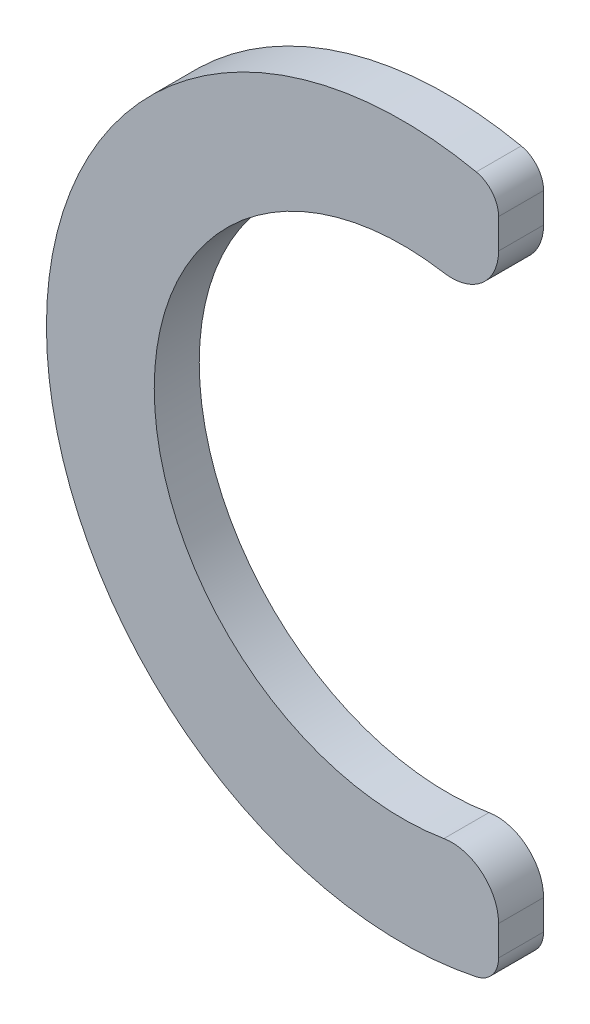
ISO-10303-21;
HEADER;
FILE_DESCRIPTION(('STEP AP214'),'2;1');
FILE_NAME('part.step','',(''),(''),'','','');
FILE_SCHEMA(('AUTOMOTIVE_DESIGN { 1 0 10303 214 1 1 1 1 }'));
ENDSEC;
DATA;
#1=APPLICATION_CONTEXT('core data for automotive mechanical design processes');
#2=APPLICATION_PROTOCOL_DEFINITION('international standard','automotive_design',2000,#1);
#3=PRODUCT_CONTEXT('',#1,'mechanical');
#4=PRODUCT('Part','Part','',(#3));
#5=PRODUCT_RELATED_PRODUCT_CATEGORY('part','',(#4));
#6=PRODUCT_DEFINITION_FORMATION('','',#4);
#7=PRODUCT_DEFINITION_CONTEXT('part definition',#1,'design');
#8=PRODUCT_DEFINITION('design','',#6,#7);
#9=PRODUCT_DEFINITION_SHAPE('','',#8);
#10=(LENGTH_UNIT() NAMED_UNIT(*) SI_UNIT(.MILLI.,.METRE.));
#11=(NAMED_UNIT(*) PLANE_ANGLE_UNIT() SI_UNIT($,.RADIAN.));
#12=(NAMED_UNIT(*) SI_UNIT($,.STERADIAN.) SOLID_ANGLE_UNIT());
#13=UNCERTAINTY_MEASURE_WITH_UNIT(LENGTH_MEASURE(1.E-05),#10,'distance_accuracy_value','');
#14=(GEOMETRIC_REPRESENTATION_CONTEXT(3) GLOBAL_UNCERTAINTY_ASSIGNED_CONTEXT((#13)) GLOBAL_UNIT_ASSIGNED_CONTEXT((#10,
#11,#12)) REPRESENTATION_CONTEXT('',''));
#15=CARTESIAN_POINT('',(0.,0.,0.));
#16=DIRECTION('',(0.,0.,1.));
#17=DIRECTION('',(1.,0.,0.));
#18=AXIS2_PLACEMENT_3D('',#15,#16,#17);
#19=CARTESIAN_POINT('',(1.02320568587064,-3.84665904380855,49.52));
#20=DIRECTION('',(0.,0.,-1.));
#21=DIRECTION('',(-1.,0.,0.));
#22=AXIS2_PLACEMENT_3D('',#19,#20,#21);
#23=PLANE('',#22);
#24=CARTESIAN_POINT('',(0.52320568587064,-3.10624464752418,49.52));
#25=DIRECTION('',(0.,0.,-1.));
#26=DIRECTION('',(0.,1.,0.));
#27=AXIS2_PLACEMENT_3D('',#24,#25,#26);
#28=CIRCLE('',#27,0.5);
#29=CARTESIAN_POINT('',(0.440157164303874,-2.61318994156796,49.52));
#30=VERTEX_POINT('',#29);
#31=CARTESIAN_POINT('',(1.02320568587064,-3.10624464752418,49.52));
#32=VERTEX_POINT('',#31);
#33=EDGE_CURVE('E101',#30,#32,#28,.T.);
#34=ORIENTED_EDGE('',*,*,#33,.T.);
#35=DIRECTION('',(0.,1.,0.));
#36=VECTOR('',#35,1.);
#37=CARTESIAN_POINT('',(1.02320568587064,-3.84665904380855,49.52));
#38=LINE('',#37,#36);
#39=CARTESIAN_POINT('',(1.02320568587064,-3.42446689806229,49.52));
#40=VERTEX_POINT('',#39);
#41=EDGE_CURVE('E100',#32,#40,#38,.F.);
#42=ORIENTED_EDGE('',*,*,#41,.T.);
#43=CARTESIAN_POINT('',(0.72320568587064,-3.42446689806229,49.52));
#44=DIRECTION('',(0.,0.,-1.));
#45=DIRECTION('',(0.,1.,0.));
#46=AXIS2_PLACEMENT_3D('',#43,#44,#45);
#47=CIRCLE('',#46,0.3);
#48=CARTESIAN_POINT('',(0.785194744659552,-3.71799263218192,49.52));
#49=VERTEX_POINT('',#48);
#50=EDGE_CURVE('E20',#40,#49,#47,.T.);
#51=ORIENTED_EDGE('',*,*,#50,.T.);
#52=CARTESIAN_POINT('',(0.,0.,49.52));
#53=DIRECTION('',(0.,0.,-1.));
#54=DIRECTION('',(0.,1.,0.));
#55=AXIS2_PLACEMENT_3D('',#52,#53,#54);
#56=CIRCLE('',#55,3.8);
#57=CARTESIAN_POINT('',(0.785194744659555,3.71799263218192,49.52));
#58=VERTEX_POINT('',#57);
#59=EDGE_CURVE('E83',#58,#49,#56,.F.);
#60=ORIENTED_EDGE('',*,*,#59,.F.);
#61=CARTESIAN_POINT('',(0.72320568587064,3.42446689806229,49.52));
#62=DIRECTION('',(0.,0.,-1.));
#63=DIRECTION('',(0.,1.,0.));
#64=AXIS2_PLACEMENT_3D('',#61,#62,#63);
#65=CIRCLE('',#64,0.3);
#66=CARTESIAN_POINT('',(1.02320568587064,3.42446689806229,49.52));
#67=VERTEX_POINT('',#66);
#68=EDGE_CURVE('E111',#67,#58,#65,.F.);
#69=ORIENTED_EDGE('',*,*,#68,.F.);
#70=DIRECTION('',(0.,1.,0.));
#71=VECTOR('',#70,1.);
#72=CARTESIAN_POINT('',(1.02320568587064,3.10624464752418,49.52));
#73=LINE('',#72,#71);
#74=CARTESIAN_POINT('',(1.02320568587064,3.10624464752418,49.52));
#75=VERTEX_POINT('',#74);
#76=EDGE_CURVE('E127',#75,#67,#73,.T.);
#77=ORIENTED_EDGE('',*,*,#76,.F.);
#78=CARTESIAN_POINT('',(0.52320568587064,3.10624464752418,49.52));
#79=DIRECTION('',(0.,0.,-1.));
#80=DIRECTION('',(0.,1.,0.));
#81=AXIS2_PLACEMENT_3D('',#78,#79,#80);
#82=CIRCLE('',#81,0.5);
#83=CARTESIAN_POINT('',(0.440157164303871,2.61318994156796,49.52));
#84=VERTEX_POINT('',#83);
#85=EDGE_CURVE('E108',#84,#75,#82,.F.);
#86=ORIENTED_EDGE('',*,*,#85,.F.);
#87=CARTESIAN_POINT('',(0.,0.,49.52));
#88=DIRECTION('',(0.,0.,-1.));
#89=DIRECTION('',(-1.,0.,0.));
#90=AXIS2_PLACEMENT_3D('',#87,#88,#89);
#91=CIRCLE('',#90,2.65);
#92=EDGE_CURVE('E103',#84,#30,#91,.F.);
#93=ORIENTED_EDGE('',*,*,#92,.T.);
#94=EDGE_LOOP('',(#34,#42,#51,#60,#69,#77,#86,#93));
#95=FACE_BOUND('',#94,.T.);
#96=ADVANCED_FACE('F17',(#95),#23,.T.);
#97=CARTESIAN_POINT('',(0.,0.,50.));
#98=DIRECTION('',(0.,0.,-1.));
#99=DIRECTION('',(-1.,0.,0.));
#100=AXIS2_PLACEMENT_3D('',#97,#98,#99);
#101=CYLINDRICAL_SURFACE('',#100,2.65);
#102=DIRECTION('',(0.,0.,-1.));
#103=VECTOR('',#102,1.);
#104=CARTESIAN_POINT('',(0.440157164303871,2.61318994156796,49.52));
#105=LINE('',#104,#103);
#106=CARTESIAN_POINT('',(0.440157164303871,2.61318994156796,50.));
#107=VERTEX_POINT('',#106);
#108=EDGE_CURVE('E107',#107,#84,#105,.T.);
#109=ORIENTED_EDGE('',*,*,#108,.F.);
#110=CARTESIAN_POINT('',(0.,0.,50.));
#111=DIRECTION('',(0.,0.,-1.));
#112=DIRECTION('',(-1.,0.,0.));
#113=AXIS2_PLACEMENT_3D('',#110,#111,#112);
#114=CIRCLE('',#113,2.65);
#115=CARTESIAN_POINT('',(0.440157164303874,-2.61318994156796,50.));
#116=VERTEX_POINT('',#115);
#117=EDGE_CURVE('E114',#116,#107,#114,.T.);
#118=ORIENTED_EDGE('',*,*,#117,.F.);
#119=DIRECTION('',(0.,0.,-1.));
#120=VECTOR('',#119,1.);
#121=CARTESIAN_POINT('',(0.440157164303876,-2.61318994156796,49.52));
#122=LINE('',#121,#120);
#123=EDGE_CURVE('E117',#30,#116,#122,.F.);
#124=ORIENTED_EDGE('',*,*,#123,.F.);
#125=ORIENTED_EDGE('',*,*,#92,.F.);
#126=EDGE_LOOP('',(#109,#118,#124,#125));
#127=FACE_BOUND('',#126,.T.);
#128=ADVANCED_FACE('F152',(#127),#101,.F.);
#129=CARTESIAN_POINT('',(0.52320568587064,3.10624464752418,49.52));
#130=DIRECTION('',(0.,0.,-1.));
#131=DIRECTION('',(0.,1.,0.));
#132=AXIS2_PLACEMENT_3D('',#129,#130,#131);
#133=CYLINDRICAL_SURFACE('',#132,0.5);
#134=ORIENTED_EDGE('',*,*,#85,.T.);
#135=DIRECTION('',(0.,0.,-1.));
#136=VECTOR('',#135,1.);
#137=CARTESIAN_POINT('',(1.02320568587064,3.10624464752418,50.));
#138=LINE('',#137,#136);
#139=CARTESIAN_POINT('',(1.02320568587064,3.10624464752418,50.));
#140=VERTEX_POINT('',#139);
#141=EDGE_CURVE('E110',#140,#75,#138,.T.);
#142=ORIENTED_EDGE('',*,*,#141,.F.);
#143=CARTESIAN_POINT('',(0.52320568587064,3.10624464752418,50.));
#144=DIRECTION('',(0.,0.,-1.));
#145=DIRECTION('',(0.,1.,0.));
#146=AXIS2_PLACEMENT_3D('',#143,#144,#145);
#147=CIRCLE('',#146,0.5);
#148=EDGE_CURVE('E116',#107,#140,#147,.F.);
#149=ORIENTED_EDGE('',*,*,#148,.F.);
#150=ORIENTED_EDGE('',*,*,#108,.T.);
#151=EDGE_LOOP('',(#134,#142,#149,#150));
#152=FACE_BOUND('',#151,.T.);
#153=ADVANCED_FACE('F157',(#152),#133,.T.);
#154=CARTESIAN_POINT('',(1.02320568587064,3.10624464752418,50.));
#155=DIRECTION('',(1.,0.,0.));
#156=DIRECTION('',(0.,0.,-1.));
#157=AXIS2_PLACEMENT_3D('',#154,#155,#156);
#158=PLANE('',#157);
#159=ORIENTED_EDGE('',*,*,#76,.T.);
#160=DIRECTION('',(0.,0.,-1.));
#161=VECTOR('',#160,1.);
#162=CARTESIAN_POINT('',(1.02320568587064,3.42446689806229,49.52));
#163=LINE('',#162,#161);
#164=CARTESIAN_POINT('',(1.02320568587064,3.42446689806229,50.));
#165=VERTEX_POINT('',#164);
#166=EDGE_CURVE('E112',#165,#67,#163,.T.);
#167=ORIENTED_EDGE('',*,*,#166,.F.);
#168=DIRECTION('',(0.,1.,0.));
#169=VECTOR('',#168,1.);
#170=CARTESIAN_POINT('',(1.02320568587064,-3.84826625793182,50.));
#171=LINE('',#170,#169);
#172=EDGE_CURVE('E120',#140,#165,#171,.T.);
#173=ORIENTED_EDGE('',*,*,#172,.F.);
#174=ORIENTED_EDGE('',*,*,#141,.T.);
#175=EDGE_LOOP('',(#159,#167,#173,#174));
#176=FACE_BOUND('',#175,.T.);
#177=ADVANCED_FACE('F160',(#176),#158,.T.);
#178=CARTESIAN_POINT('',(0.72320568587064,3.42446689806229,49.52));
#179=DIRECTION('',(0.,0.,-1.));
#180=DIRECTION('',(0.,1.,0.));
#181=AXIS2_PLACEMENT_3D('',#178,#179,#180);
#182=CYLINDRICAL_SURFACE('',#181,0.3);
#183=ORIENTED_EDGE('',*,*,#68,.T.);
#184=DIRECTION('',(0.,0.,-1.));
#185=VECTOR('',#184,1.);
#186=CARTESIAN_POINT('',(0.785194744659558,3.71799263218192,49.52));
#187=LINE('',#186,#185);
#188=CARTESIAN_POINT('',(0.785194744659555,3.71799263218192,50.));
#189=VERTEX_POINT('',#188);
#190=EDGE_CURVE('E88',#189,#58,#187,.T.);
#191=ORIENTED_EDGE('',*,*,#190,.F.);
#192=CARTESIAN_POINT('',(0.72320568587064,3.4244668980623,50.));
#193=DIRECTION('',(0.,0.,-1.));
#194=DIRECTION('',(0.,1.,0.));
#195=AXIS2_PLACEMENT_3D('',#192,#193,#194);
#196=CIRCLE('',#195,0.3);
#197=EDGE_CURVE('E121',#165,#189,#196,.F.);
#198=ORIENTED_EDGE('',*,*,#197,.F.);
#199=ORIENTED_EDGE('',*,*,#166,.T.);
#200=EDGE_LOOP('',(#183,#191,#198,#199));
#201=FACE_BOUND('',#200,.T.);
#202=ADVANCED_FACE('F163',(#201),#182,.T.);
#203=CARTESIAN_POINT('',(0.,0.,49.52));
#204=DIRECTION('',(0.,0.,-1.));
#205=DIRECTION('',(0.,1.,0.));
#206=AXIS2_PLACEMENT_3D('',#203,#204,#205);
#207=CYLINDRICAL_SURFACE('',#206,3.8);
#208=ORIENTED_EDGE('',*,*,#59,.T.);
#209=DIRECTION('',(0.,0.,-1.));
#210=VECTOR('',#209,1.);
#211=CARTESIAN_POINT('',(0.785194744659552,-3.71799263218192,49.52));
#212=LINE('',#211,#210);
#213=CARTESIAN_POINT('',(0.785194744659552,-3.71799263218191,50.));
#214=VERTEX_POINT('',#213);
#215=EDGE_CURVE('E86',#214,#49,#212,.T.);
#216=ORIENTED_EDGE('',*,*,#215,.F.);
#217=CARTESIAN_POINT('',(0.,0.,50.));
#218=DIRECTION('',(0.,0.,-1.));
#219=DIRECTION('',(0.,1.,0.));
#220=AXIS2_PLACEMENT_3D('',#217,#218,#219);
#221=CIRCLE('',#220,3.8);
#222=EDGE_CURVE('E124',#189,#214,#221,.F.);
#223=ORIENTED_EDGE('',*,*,#222,.F.);
#224=ORIENTED_EDGE('',*,*,#190,.T.);
#225=EDGE_LOOP('',(#208,#216,#223,#224));
#226=FACE_BOUND('',#225,.T.);
#227=ADVANCED_FACE('F84',(#226),#207,.T.);
#228=CARTESIAN_POINT('',(0.72320568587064,-3.42446689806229,49.52));
#229=DIRECTION('',(0.,0.,-1.));
#230=DIRECTION('',(0.,1.,0.));
#231=AXIS2_PLACEMENT_3D('',#228,#229,#230);
#232=CYLINDRICAL_SURFACE('',#231,0.3);
#233=CARTESIAN_POINT('',(0.72320568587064,-3.42446689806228,50.));
#234=DIRECTION('',(0.,0.,-1.));
#235=DIRECTION('',(0.,1.,0.));
#236=AXIS2_PLACEMENT_3D('',#233,#234,#235);
#237=CIRCLE('',#236,0.3);
#238=CARTESIAN_POINT('',(1.02320568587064,-3.42446689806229,50.));
#239=VERTEX_POINT('',#238);
#240=EDGE_CURVE('E95',#214,#239,#237,.F.);
#241=ORIENTED_EDGE('',*,*,#240,.F.);
#242=ORIENTED_EDGE('',*,*,#215,.T.);
#243=ORIENTED_EDGE('',*,*,#50,.F.);
#244=DIRECTION('',(0.,0.,-1.));
#245=VECTOR('',#244,1.);
#246=CARTESIAN_POINT('',(1.02320568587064,-3.42446689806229,50.));
#247=LINE('',#246,#245);
#248=EDGE_CURVE('E96',#239,#40,#247,.T.);
#249=ORIENTED_EDGE('',*,*,#248,.F.);
#250=EDGE_LOOP('',(#241,#242,#243,#249));
#251=FACE_BOUND('',#250,.T.);
#252=ADVANCED_FACE('F93',(#251),#232,.T.);
#253=CARTESIAN_POINT('',(1.02320568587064,-3.42446689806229,50.));
#254=DIRECTION('',(1.,0.,0.));
#255=DIRECTION('',(0.,0.,-1.));
#256=AXIS2_PLACEMENT_3D('',#253,#254,#255);
#257=PLANE('',#256);
#258=DIRECTION('',(0.,1.,0.));
#259=VECTOR('',#258,1.);
#260=CARTESIAN_POINT('',(1.02320568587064,-3.84826625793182,50.));
#261=LINE('',#260,#259);
#262=CARTESIAN_POINT('',(1.02320568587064,-3.10624464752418,50.));
#263=VERTEX_POINT('',#262);
#264=EDGE_CURVE('E26',#239,#263,#261,.T.);
#265=ORIENTED_EDGE('',*,*,#264,.F.);
#266=ORIENTED_EDGE('',*,*,#248,.T.);
#267=ORIENTED_EDGE('',*,*,#41,.F.);
#268=DIRECTION('',(0.,0.,-1.));
#269=VECTOR('',#268,1.);
#270=CARTESIAN_POINT('',(1.02320568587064,-3.10624464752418,49.52));
#271=LINE('',#270,#269);
#272=EDGE_CURVE('E35',#263,#32,#271,.T.);
#273=ORIENTED_EDGE('',*,*,#272,.F.);
#274=EDGE_LOOP('',(#265,#266,#267,#273));
#275=FACE_BOUND('',#274,.T.);
#276=ADVANCED_FACE('F146',(#275),#257,.T.);
#277=CARTESIAN_POINT('',(0.52320568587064,-3.10624464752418,49.52));
#278=DIRECTION('',(0.,0.,-1.));
#279=DIRECTION('',(0.,1.,0.));
#280=AXIS2_PLACEMENT_3D('',#277,#278,#279);
#281=CYLINDRICAL_SURFACE('',#280,0.5);
#282=ORIENTED_EDGE('',*,*,#33,.F.);
#283=ORIENTED_EDGE('',*,*,#123,.T.);
#284=CARTESIAN_POINT('',(0.52320568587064,-3.10624464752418,50.));
#285=DIRECTION('',(0.,0.,-1.));
#286=DIRECTION('',(0.,1.,0.));
#287=AXIS2_PLACEMENT_3D('',#284,#285,#286);
#288=CIRCLE('',#287,0.5);
#289=EDGE_CURVE('E11',#263,#116,#288,.F.);
#290=ORIENTED_EDGE('',*,*,#289,.F.);
#291=ORIENTED_EDGE('',*,*,#272,.T.);
#292=EDGE_LOOP('',(#282,#283,#290,#291));
#293=FACE_BOUND('',#292,.T.);
#294=ADVANCED_FACE('F148',(#293),#281,.T.);
#295=CARTESIAN_POINT('',(-3.82893923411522,-3.84826625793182,50.));
#296=DIRECTION('',(0.,0.,1.));
#297=DIRECTION('',(1.,0.,0.));
#298=AXIS2_PLACEMENT_3D('',#295,#296,#297);
#299=PLANE('',#298);
#300=ORIENTED_EDGE('',*,*,#289,.T.);
#301=ORIENTED_EDGE('',*,*,#117,.T.);
#302=ORIENTED_EDGE('',*,*,#148,.T.);
#303=ORIENTED_EDGE('',*,*,#172,.T.);
#304=ORIENTED_EDGE('',*,*,#197,.T.);
#305=ORIENTED_EDGE('',*,*,#222,.T.);
#306=ORIENTED_EDGE('',*,*,#240,.T.);
#307=ORIENTED_EDGE('',*,*,#264,.T.);
#308=EDGE_LOOP('',(#300,#301,#302,#303,#304,#305,#306,#307));
#309=FACE_BOUND('',#308,.T.);
#310=ADVANCED_FACE('F144',(#309),#299,.T.);
#311=CLOSED_SHELL('',(#96,#128,#153,#177,#202,#227,#252,#276,#294,#310));
#312=MANIFOLD_SOLID_BREP('B1',#311);
#313=ADVANCED_BREP_SHAPE_REPRESENTATION('',(#18,#312),#14);
#314=SHAPE_DEFINITION_REPRESENTATION(#9,#313);
ENDSEC;
END-ISO-10303-21;
